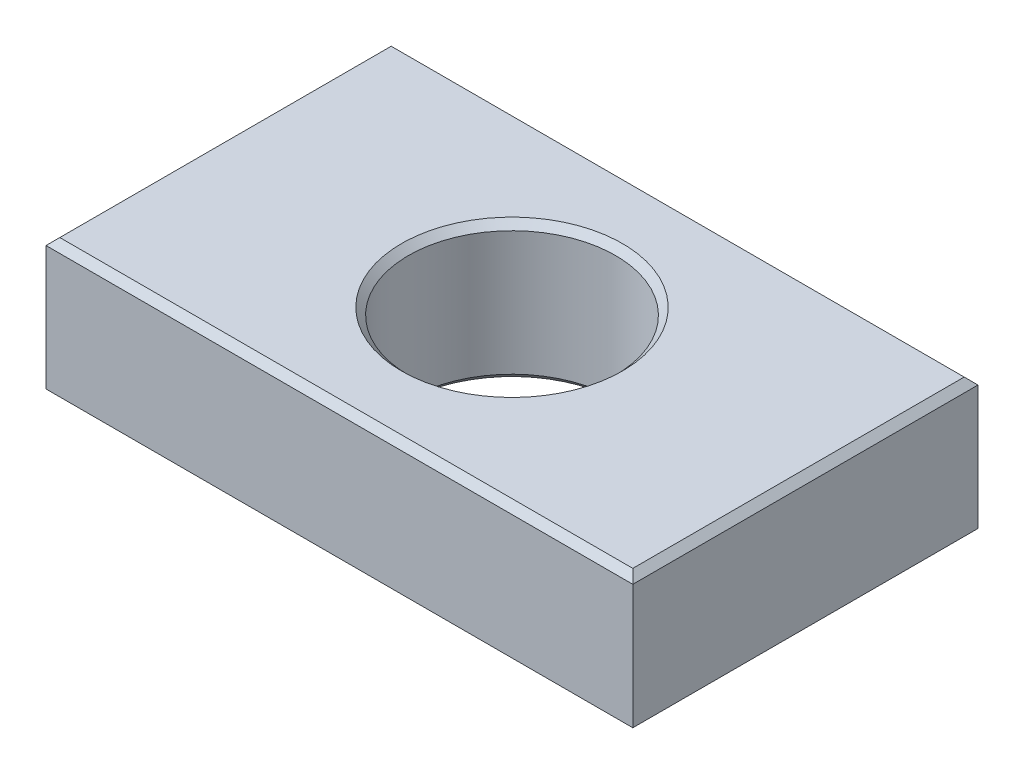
from build123d import *

# Parameters (mm, degrees)
ESQUISSE1_W          = 17
ESQUISSE1_H          = 10
ESQUISSE1_R          = 3
BASE_EXTRUSION_DEPTH = 4
CHANFREIN1_SIZE      = 0.2


with BuildPart() as part:
    # Esquisse1 → Base-Extrusion (new body)
    with BuildSketch(Plane(origin=(0, 0, 0), x_dir=(1, 0, 0), z_dir=(0, 1, 0))):
        Rectangle(ESQUISSE1_W, ESQUISSE1_H)
        with Locations(Location((0, 0, 0), (0, 0, 270))):
            Circle(ESQUISSE1_R, mode=Mode.SUBTRACT)
    extrude(amount=BASE_EXTRUSION_DEPTH)

    # Chanfrein1
    chanfrein1_edges = [part.edges().sort_by_distance(p)[0] for p in [
        (0, 0, -5),
        (0, 4, -5),
        (8.5, 0, 0),
        (8.5, 4, 0),
        (0, 0, 5),
        (0, 4, 5),
        (-8.5, 0, 0),
        (-8.5, 4, 0),
        (0, 0, -3),
        (0, 4, -3),
    ]]
    chamfer(chanfrein1_edges, length=CHANFREIN1_SIZE)


solid = part.part
